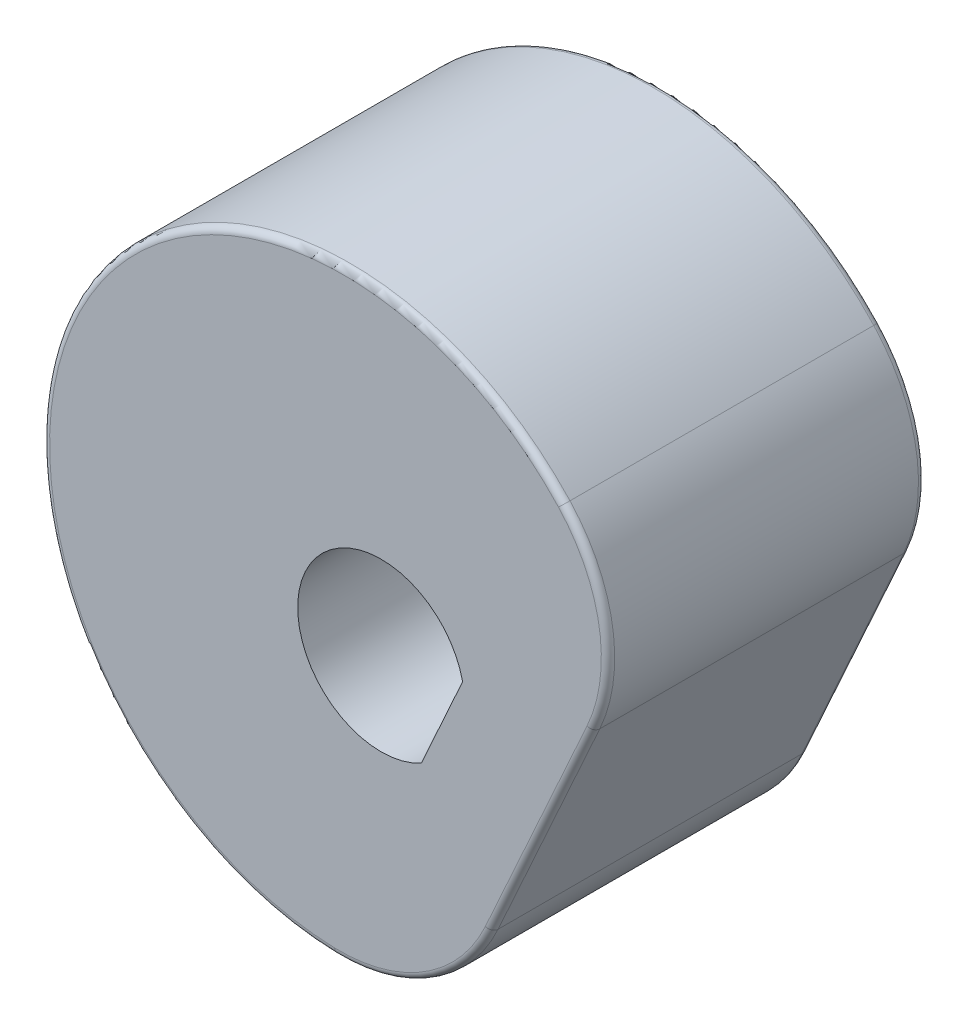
ISO-10303-21;
HEADER;
FILE_DESCRIPTION(('STEP AP214'),'2;1');
FILE_NAME('part.step','',(''),(''),'','','');
FILE_SCHEMA(('AUTOMOTIVE_DESIGN { 1 0 10303 214 1 1 1 1 }'));
ENDSEC;
DATA;
#1=APPLICATION_CONTEXT('core data for automotive mechanical design processes');
#2=APPLICATION_PROTOCOL_DEFINITION('international standard','automotive_design',2000,#1);
#3=PRODUCT_CONTEXT('',#1,'mechanical');
#4=PRODUCT('Part','Part','',(#3));
#5=PRODUCT_RELATED_PRODUCT_CATEGORY('part','',(#4));
#6=PRODUCT_DEFINITION_FORMATION('','',#4);
#7=PRODUCT_DEFINITION_CONTEXT('part definition',#1,'design');
#8=PRODUCT_DEFINITION('design','',#6,#7);
#9=PRODUCT_DEFINITION_SHAPE('','',#8);
#10=(LENGTH_UNIT() NAMED_UNIT(*) SI_UNIT(.MILLI.,.METRE.));
#11=(NAMED_UNIT(*) PLANE_ANGLE_UNIT() SI_UNIT($,.RADIAN.));
#12=(NAMED_UNIT(*) SI_UNIT($,.STERADIAN.) SOLID_ANGLE_UNIT());
#13=UNCERTAINTY_MEASURE_WITH_UNIT(LENGTH_MEASURE(1.E-05),#10,'distance_accuracy_value','');
#14=(GEOMETRIC_REPRESENTATION_CONTEXT(3) GLOBAL_UNCERTAINTY_ASSIGNED_CONTEXT((#13)) GLOBAL_UNIT_ASSIGNED_CONTEXT((#10,
#11,#12)) REPRESENTATION_CONTEXT('',''));
#15=CARTESIAN_POINT('',(0.,0.,0.));
#16=DIRECTION('',(0.,0.,1.));
#17=DIRECTION('',(1.,0.,0.));
#18=AXIS2_PLACEMENT_3D('',#15,#16,#17);
#19=CARTESIAN_POINT('',(-8.59914116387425,107.854598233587,48.1999999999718));
#20=DIRECTION('',(0.,0.,1.));
#21=DIRECTION('',(1.,0.,0.));
#22=AXIS2_PLACEMENT_3D('',#19,#20,#21);
#23=CYLINDRICAL_SURFACE('',#22,4.99999999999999);
#24=DIRECTION('',(0.,0.,1.));
#25=VECTOR('',#24,1.);
#26=CARTESIAN_POINT('',(-4.93802283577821,111.259919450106,48.1999999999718));
#27=LINE('',#26,#25);
#28=CARTESIAN_POINT('',(-4.93802283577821,111.259919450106,48.3999999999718));
#29=VERTEX_POINT('',#28);
#30=CARTESIAN_POINT('',(-4.93802283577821,111.259919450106,57.4999999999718));
#31=VERTEX_POINT('',#30);
#32=EDGE_CURVE('E140',#29,#31,#27,.T.);
#33=ORIENTED_EDGE('',*,*,#32,.T.);
#34=CARTESIAN_POINT('',(-8.59914116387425,107.854598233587,57.4999999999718));
#35=DIRECTION('',(0.,0.,1.));
#36=DIRECTION('',(1.,0.,0.));
#37=AXIS2_PLACEMENT_3D('',#34,#35,#36);
#38=CIRCLE('',#37,4.99999999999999);
#39=CARTESIAN_POINT('',(-4.0448911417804,105.790910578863,57.4999999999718));
#40=VERTEX_POINT('',#39);
#41=EDGE_CURVE('E180',#31,#40,#38,.F.);
#42=ORIENTED_EDGE('',*,*,#41,.T.);
#43=DIRECTION('',(0.,0.,1.));
#44=VECTOR('',#43,1.);
#45=CARTESIAN_POINT('',(-4.0448911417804,105.790910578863,48.1999999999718));
#46=LINE('',#45,#44);
#47=CARTESIAN_POINT('',(-4.0448911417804,105.790910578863,48.3999999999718));
#48=VERTEX_POINT('',#47);
#49=EDGE_CURVE('E142',#48,#40,#46,.T.);
#50=ORIENTED_EDGE('',*,*,#49,.F.);
#51=CARTESIAN_POINT('',(-8.59914116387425,107.854598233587,48.3999999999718));
#52=DIRECTION('',(0.,0.,1.));
#53=DIRECTION('',(1.,0.,0.));
#54=AXIS2_PLACEMENT_3D('',#51,#52,#53);
#55=CIRCLE('',#54,4.99999999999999);
#56=EDGE_CURVE('E60',#48,#29,#55,.T.);
#57=ORIENTED_EDGE('',*,*,#56,.T.);
#58=EDGE_LOOP('',(#33,#42,#50,#57));
#59=FACE_BOUND('',#58,.T.);
#60=ADVANCED_FACE('F37',(#59),#23,.T.);
#61=CARTESIAN_POINT('',(-7.09110397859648,99.0683744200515,48.1999999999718));
#62=DIRECTION('',(0.910850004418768,-0.412737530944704,0.));
#63=DIRECTION('',(0.412737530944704,0.910850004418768,0.));
#64=AXIS2_PLACEMENT_3D('',#61,#62,#63);
#65=PLANE('',#64);
#66=ORIENTED_EDGE('',*,*,#49,.T.);
#67=DIRECTION('',(0.412737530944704,0.910850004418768,0.));
#68=VECTOR('',#67,1.);
#69=CARTESIAN_POINT('',(-7.09110397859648,99.0683744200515,57.4999999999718));
#70=LINE('',#69,#68);
#71=CARTESIAN_POINT('',(-7.09110397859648,99.0683744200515,57.4999999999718));
#72=VERTEX_POINT('',#71);
#73=EDGE_CURVE('E177',#40,#72,#70,.F.);
#74=ORIENTED_EDGE('',*,*,#73,.T.);
#75=DIRECTION('',(0.,0.,1.));
#76=VECTOR('',#75,1.);
#77=CARTESIAN_POINT('',(-7.09110397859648,99.0683744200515,48.1999999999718));
#78=LINE('',#77,#76);
#79=CARTESIAN_POINT('',(-7.09110397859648,99.0683744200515,48.3999999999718));
#80=VERTEX_POINT('',#79);
#81=EDGE_CURVE('E146',#80,#72,#78,.T.);
#82=ORIENTED_EDGE('',*,*,#81,.F.);
#83=DIRECTION('',(0.412737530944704,0.910850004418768,0.));
#84=VECTOR('',#83,1.);
#85=CARTESIAN_POINT('',(-4.0448911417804,105.790910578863,48.3999999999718));
#86=LINE('',#85,#84);
#87=EDGE_CURVE('E175',#80,#48,#86,.T.);
#88=ORIENTED_EDGE('',*,*,#87,.T.);
#89=EDGE_LOOP('',(#66,#74,#82,#88));
#90=FACE_BOUND('',#89,.T.);
#91=ADVANCED_FACE('F211',(#90),#65,.T.);
#92=CARTESIAN_POINT('',(-11.6453540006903,101.132062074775,48.1999999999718));
#93=DIRECTION('',(0.,0.,1.));
#94=DIRECTION('',(1.,0.,0.));
#95=AXIS2_PLACEMENT_3D('',#92,#93,#94);
#96=CYLINDRICAL_SURFACE('',#95,4.99999999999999);
#97=DIRECTION('',(0.,0.,1.));
#98=VECTOR('',#97,1.);
#99=CARTESIAN_POINT('',(-11.7920017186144,96.1342130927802,48.1999999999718));
#100=LINE('',#99,#98);
#101=CARTESIAN_POINT('',(-11.7920017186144,96.1342130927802,48.3999999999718));
#102=VERTEX_POINT('',#101);
#103=CARTESIAN_POINT('',(-11.7920017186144,96.1342130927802,57.4999999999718));
#104=VERTEX_POINT('',#103);
#105=EDGE_CURVE('E149',#102,#104,#100,.T.);
#106=ORIENTED_EDGE('',*,*,#105,.F.);
#107=CARTESIAN_POINT('',(-11.6453540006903,101.132062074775,48.3999999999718));
#108=DIRECTION('',(0.,0.,1.));
#109=DIRECTION('',(1.,0.,0.));
#110=AXIS2_PLACEMENT_3D('',#107,#108,#109);
#111=CIRCLE('',#110,4.99999999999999);
#112=EDGE_CURVE('E154',#102,#80,#111,.T.);
#113=ORIENTED_EDGE('',*,*,#112,.T.);
#114=ORIENTED_EDGE('',*,*,#81,.T.);
#115=CARTESIAN_POINT('',(-11.6453540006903,101.132062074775,57.4999999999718));
#116=DIRECTION('',(0.,0.,1.));
#117=DIRECTION('',(1.,0.,0.));
#118=AXIS2_PLACEMENT_3D('',#115,#116,#117);
#119=CIRCLE('',#118,4.99999999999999);
#120=EDGE_CURVE('E145',#72,#104,#119,.F.);
#121=ORIENTED_EDGE('',*,*,#120,.T.);
#122=EDGE_LOOP('',(#106,#113,#114,#121));
#123=FACE_BOUND('',#122,.T.);
#124=ADVANCED_FACE('F222',(#123),#96,.T.);
#125=CARTESIAN_POINT('',(-11.528035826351,105.130341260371,48.1999999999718));
#126=DIRECTION('',(0.,0.,1.));
#127=DIRECTION('',(1.,0.,0.));
#128=AXIS2_PLACEMENT_3D('',#125,#126,#127);
#129=CYLINDRICAL_SURFACE('',#128,8.99999999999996);
#130=ORIENTED_EDGE('',*,*,#32,.F.);
#131=CARTESIAN_POINT('',(-11.528035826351,105.130341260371,48.3999999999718));
#132=DIRECTION('',(0.,0.,1.));
#133=DIRECTION('',(1.,0.,0.));
#134=AXIS2_PLACEMENT_3D('',#131,#132,#133);
#135=CIRCLE('',#134,8.99999999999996);
#136=EDGE_CURVE('E11',#29,#102,#135,.T.);
#137=ORIENTED_EDGE('',*,*,#136,.T.);
#138=ORIENTED_EDGE('',*,*,#105,.T.);
#139=CARTESIAN_POINT('',(-11.528035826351,105.130341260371,57.4999999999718));
#140=DIRECTION('',(0.,0.,1.));
#141=DIRECTION('',(1.,0.,0.));
#142=AXIS2_PLACEMENT_3D('',#139,#140,#141);
#143=CIRCLE('',#142,8.99999999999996);
#144=EDGE_CURVE('E46',#104,#31,#143,.F.);
#145=ORIENTED_EDGE('',*,*,#144,.T.);
#146=EDGE_LOOP('',(#130,#137,#138,#145));
#147=FACE_BOUND('',#146,.T.);
#148=ADVANCED_FACE('F237',(#147),#129,.T.);
#149=CARTESIAN_POINT('',(-8.59914116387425,107.854598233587,48.1999999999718));
#150=DIRECTION('',(0.,0.,1.));
#151=DIRECTION('',(1.,0.,0.));
#152=AXIS2_PLACEMENT_3D('',#149,#150,#151);
#153=PLANE('',#152);
#154=DIRECTION('',(0.412737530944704,0.910850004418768,0.));
#155=VECTOR('',#154,1.);
#156=CARTESIAN_POINT('',(-7.27327397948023,99.1509219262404,48.1999999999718));
#157=LINE('',#156,#155);
#158=CARTESIAN_POINT('',(-4.22706114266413,105.873458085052,48.1999999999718));
#159=VERTEX_POINT('',#158);
#160=CARTESIAN_POINT('',(-7.27327397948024,99.1509219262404,48.1999999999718));
#161=VERTEX_POINT('',#160);
#162=EDGE_CURVE('E161',#159,#161,#157,.F.);
#163=ORIENTED_EDGE('',*,*,#162,.T.);
#164=CARTESIAN_POINT('',(-11.6453540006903,101.132062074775,48.1999999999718));
#165=DIRECTION('',(0.,0.,1.));
#166=DIRECTION('',(1.,0.,0.));
#167=AXIS2_PLACEMENT_3D('',#164,#165,#166);
#168=CIRCLE('',#167,4.79999999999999);
#169=CARTESIAN_POINT('',(-11.7861358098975,96.33412705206,48.1999999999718));
#170=VERTEX_POINT('',#169);
#171=EDGE_CURVE('E163',#161,#170,#168,.F.);
#172=ORIENTED_EDGE('',*,*,#171,.T.);
#173=CARTESIAN_POINT('',(-11.528035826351,105.130341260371,48.1999999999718));
#174=DIRECTION('',(0.,0.,1.));
#175=DIRECTION('',(1.,0.,0.));
#176=AXIS2_PLACEMENT_3D('',#173,#174,#175);
#177=CIRCLE('',#176,8.79999999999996);
#178=CARTESIAN_POINT('',(-5.08446756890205,111.123706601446,48.1999999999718));
#179=VERTEX_POINT('',#178);
#180=EDGE_CURVE('E157',#170,#179,#177,.F.);
#181=ORIENTED_EDGE('',*,*,#180,.T.);
#182=CARTESIAN_POINT('',(-8.59914116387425,107.854598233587,48.1999999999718));
#183=DIRECTION('',(0.,0.,1.));
#184=DIRECTION('',(1.,0.,0.));
#185=AXIS2_PLACEMENT_3D('',#182,#183,#184);
#186=CIRCLE('',#185,4.79999999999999);
#187=EDGE_CURVE('E159',#179,#159,#186,.F.);
#188=ORIENTED_EDGE('',*,*,#187,.T.);
#189=EDGE_LOOP('',(#163,#172,#181,#188));
#190=FACE_BOUND('',#189,.T.);
#191=DIRECTION('',(0.412737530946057,0.910850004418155,0.));
#192=VECTOR('',#191,1.);
#193=CARTESIAN_POINT('',(-7.95469627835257,105.157951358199,48.1999999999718));
#194=LINE('',#193,#192);
#195=CARTESIAN_POINT('',(-9.19290887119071,102.425401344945,48.1999999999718));
#196=VERTEX_POINT('',#195);
#197=CARTESIAN_POINT('',(-7.95469627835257,105.157951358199,48.1999999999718));
#198=VERTEX_POINT('',#197);
#199=EDGE_CURVE('E127',#196,#198,#194,.T.);
#200=ORIENTED_EDGE('',*,*,#199,.T.);
#201=CARTESIAN_POINT('',(-10.395502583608,104.617151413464,48.1999999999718));
#202=DIRECTION('',(0.,0.,1.));
#203=DIRECTION('',(-1.,0.,0.));
#204=AXIS2_PLACEMENT_3D('',#201,#202,#203);
#205=CIRCLE('',#204,2.49999999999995);
#206=EDGE_CURVE('E119',#198,#196,#205,.T.);
#207=ORIENTED_EDGE('',*,*,#206,.T.);
#208=EDGE_LOOP('',(#200,#207));
#209=FACE_BOUND('',#208,.T.);
#210=ADVANCED_FACE('F133',(#190,#209),#153,.F.);
#211=CARTESIAN_POINT('',(-8.59914116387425,107.854598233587,57.6999999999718));
#212=DIRECTION('',(0.,0.,1.));
#213=DIRECTION('',(1.,0.,0.));
#214=AXIS2_PLACEMENT_3D('',#211,#212,#213);
#215=PLANE('',#214);
#216=CARTESIAN_POINT('',(-11.528035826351,105.130341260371,57.6999999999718));
#217=DIRECTION('',(0.,0.,1.));
#218=DIRECTION('',(1.,0.,0.));
#219=AXIS2_PLACEMENT_3D('',#216,#217,#218);
#220=CIRCLE('',#219,8.79999999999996);
#221=CARTESIAN_POINT('',(-5.08446756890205,111.123706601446,57.6999999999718));
#222=VERTEX_POINT('',#221);
#223=CARTESIAN_POINT('',(-11.7861358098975,96.33412705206,57.6999999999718));
#224=VERTEX_POINT('',#223);
#225=EDGE_CURVE('E166',#222,#224,#220,.T.);
#226=ORIENTED_EDGE('',*,*,#225,.T.);
#227=CARTESIAN_POINT('',(-11.6453540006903,101.132062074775,57.6999999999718));
#228=DIRECTION('',(0.,0.,1.));
#229=DIRECTION('',(1.,0.,0.));
#230=AXIS2_PLACEMENT_3D('',#227,#228,#229);
#231=CIRCLE('',#230,4.79999999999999);
#232=CARTESIAN_POINT('',(-7.27327397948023,99.1509219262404,57.6999999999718));
#233=VERTEX_POINT('',#232);
#234=EDGE_CURVE('E172',#224,#233,#231,.T.);
#235=ORIENTED_EDGE('',*,*,#234,.T.);
#236=DIRECTION('',(0.412737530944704,0.910850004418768,0.));
#237=VECTOR('',#236,1.);
#238=CARTESIAN_POINT('',(-4.2270611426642,105.873458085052,57.6999999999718));
#239=LINE('',#238,#237);
#240=CARTESIAN_POINT('',(-4.22706114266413,105.873458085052,57.6999999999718));
#241=VERTEX_POINT('',#240);
#242=EDGE_CURVE('E170',#233,#241,#239,.T.);
#243=ORIENTED_EDGE('',*,*,#242,.T.);
#244=CARTESIAN_POINT('',(-8.59914116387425,107.854598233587,57.6999999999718));
#245=DIRECTION('',(0.,0.,1.));
#246=DIRECTION('',(1.,0.,0.));
#247=AXIS2_PLACEMENT_3D('',#244,#245,#246);
#248=CIRCLE('',#247,4.79999999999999);
#249=EDGE_CURVE('E168',#241,#222,#248,.T.);
#250=ORIENTED_EDGE('',*,*,#249,.T.);
#251=EDGE_LOOP('',(#226,#235,#243,#250));
#252=FACE_BOUND('',#251,.T.);
#253=CARTESIAN_POINT('',(-10.395502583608,104.617151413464,57.6999999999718));
#254=DIRECTION('',(0.,0.,1.));
#255=DIRECTION('',(-1.,0.,0.));
#256=AXIS2_PLACEMENT_3D('',#253,#254,#255);
#257=CIRCLE('',#256,2.49999999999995);
#258=CARTESIAN_POINT('',(-7.95469627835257,105.157951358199,57.6999999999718));
#259=VERTEX_POINT('',#258);
#260=CARTESIAN_POINT('',(-9.19290887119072,102.425401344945,57.6999999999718));
#261=VERTEX_POINT('',#260);
#262=EDGE_CURVE('E122',#259,#261,#257,.T.);
#263=ORIENTED_EDGE('',*,*,#262,.F.);
#264=DIRECTION('',(0.412737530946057,0.910850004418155,0.));
#265=VECTOR('',#264,1.);
#266=CARTESIAN_POINT('',(-7.95469627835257,105.157951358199,57.6999999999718));
#267=LINE('',#266,#265);
#268=EDGE_CURVE('E134',#261,#259,#267,.T.);
#269=ORIENTED_EDGE('',*,*,#268,.F.);
#270=EDGE_LOOP('',(#263,#269));
#271=FACE_BOUND('',#270,.T.);
#272=ADVANCED_FACE('F244',(#252,#271),#215,.T.);
#273=CARTESIAN_POINT('',(-10.395502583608,104.617151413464,48.1999999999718));
#274=DIRECTION('',(0.,0.,1.));
#275=DIRECTION('',(1.,0.,0.));
#276=AXIS2_PLACEMENT_3D('',#273,#274,#275);
#277=CYLINDRICAL_SURFACE('',#276,2.49999999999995);
#278=ORIENTED_EDGE('',*,*,#262,.T.);
#279=DIRECTION('',(0.,0.,1.));
#280=VECTOR('',#279,1.);
#281=CARTESIAN_POINT('',(-9.19290887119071,102.425401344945,48.1999999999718));
#282=LINE('',#281,#280);
#283=EDGE_CURVE('E115',#196,#261,#282,.T.);
#284=ORIENTED_EDGE('',*,*,#283,.F.);
#285=ORIENTED_EDGE('',*,*,#206,.F.);
#286=DIRECTION('',(0.,0.,1.));
#287=VECTOR('',#286,1.);
#288=CARTESIAN_POINT('',(-7.95469627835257,105.157951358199,48.1999999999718));
#289=LINE('',#288,#287);
#290=EDGE_CURVE('E126',#198,#259,#289,.T.);
#291=ORIENTED_EDGE('',*,*,#290,.T.);
#292=EDGE_LOOP('',(#278,#284,#285,#291));
#293=FACE_BOUND('',#292,.T.);
#294=ADVANCED_FACE('F117',(#293),#277,.F.);
#295=CARTESIAN_POINT('',(-7.95469627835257,105.157951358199,48.1999999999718));
#296=DIRECTION('',(0.910850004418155,-0.412737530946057,0.));
#297=DIRECTION('',(0.412737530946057,0.910850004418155,0.));
#298=AXIS2_PLACEMENT_3D('',#295,#296,#297);
#299=PLANE('',#298);
#300=ORIENTED_EDGE('',*,*,#268,.T.);
#301=ORIENTED_EDGE('',*,*,#290,.F.);
#302=ORIENTED_EDGE('',*,*,#199,.F.);
#303=ORIENTED_EDGE('',*,*,#283,.T.);
#304=EDGE_LOOP('',(#300,#301,#302,#303));
#305=FACE_BOUND('',#304,.T.);
#306=ADVANCED_FACE('F130',(#305),#299,.F.);
#307=CARTESIAN_POINT('',(-8.59914116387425,107.854598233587,48.3999999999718));
#308=DIRECTION('',(0.,0.,1.));
#309=DIRECTION('',(1.,0.,0.));
#310=AXIS2_PLACEMENT_3D('',#307,#308,#309);
#311=TOROIDAL_SURFACE('',#310,4.79999999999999,0.2);
#312=CARTESIAN_POINT('',(-4.22706114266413,105.873458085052,48.3999999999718));
#313=DIRECTION('',(-0.412737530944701,-0.910850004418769,0.));
#314=DIRECTION('',(0.910850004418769,-0.412737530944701,0.));
#315=AXIS2_PLACEMENT_3D('',#312,#313,#314);
#316=CIRCLE('',#315,0.2);
#317=EDGE_CURVE('E187',#159,#48,#316,.T.);
#318=ORIENTED_EDGE('',*,*,#317,.F.);
#319=ORIENTED_EDGE('',*,*,#187,.F.);
#320=CARTESIAN_POINT('',(-5.08446756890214,111.123706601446,48.3999999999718));
#321=DIRECTION('',(-0.681064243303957,0.732223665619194,0.));
#322=DIRECTION('',(-0.732223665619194,-0.681064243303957,0.));
#323=AXIS2_PLACEMENT_3D('',#320,#321,#322);
#324=CIRCLE('',#323,0.2);
#325=EDGE_CURVE('E138',#29,#179,#324,.T.);
#326=ORIENTED_EDGE('',*,*,#325,.F.);
#327=ORIENTED_EDGE('',*,*,#56,.F.);
#328=EDGE_LOOP('',(#318,#319,#326,#327));
#329=FACE_BOUND('',#328,.T.);
#330=ADVANCED_FACE('F233',(#329),#311,.T.);
#331=CARTESIAN_POINT('',(-11.528035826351,105.130341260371,48.3999999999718));
#332=DIRECTION('',(0.,0.,1.));
#333=DIRECTION('',(1.,0.,0.));
#334=AXIS2_PLACEMENT_3D('',#331,#332,#333);
#335=TOROIDAL_SURFACE('',#334,8.79999999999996,0.2);
#336=ORIENTED_EDGE('',*,*,#325,.T.);
#337=ORIENTED_EDGE('',*,*,#180,.F.);
#338=CARTESIAN_POINT('',(-11.7861358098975,96.33412705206,48.3999999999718));
#339=DIRECTION('',(0.999569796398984,-0.0293295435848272,0.));
#340=DIRECTION('',(0.0293295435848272,0.999569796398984,0.));
#341=AXIS2_PLACEMENT_3D('',#338,#339,#340);
#342=CIRCLE('',#341,0.2);
#343=EDGE_CURVE('E185',#102,#170,#342,.T.);
#344=ORIENTED_EDGE('',*,*,#343,.F.);
#345=ORIENTED_EDGE('',*,*,#136,.F.);
#346=EDGE_LOOP('',(#336,#337,#344,#345));
#347=FACE_BOUND('',#346,.T.);
#348=ADVANCED_FACE('F236',(#347),#335,.T.);
#349=CARTESIAN_POINT('',(-7.27327397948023,99.1509219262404,48.3999999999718));
#350=DIRECTION('',(-0.412737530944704,-0.910850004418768,0.));
#351=DIRECTION('',(0.910850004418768,-0.412737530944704,0.));
#352=AXIS2_PLACEMENT_3D('',#349,#350,#351);
#353=CYLINDRICAL_SURFACE('',#352,0.2);
#354=ORIENTED_EDGE('',*,*,#317,.T.);
#355=ORIENTED_EDGE('',*,*,#87,.F.);
#356=CARTESIAN_POINT('',(-7.27327397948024,99.1509219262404,48.3999999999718));
#357=DIRECTION('',(-0.412737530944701,-0.910850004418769,0.));
#358=DIRECTION('',(0.910850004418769,-0.412737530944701,0.));
#359=AXIS2_PLACEMENT_3D('',#356,#357,#358);
#360=CIRCLE('',#359,0.2);
#361=EDGE_CURVE('E183',#161,#80,#360,.T.);
#362=ORIENTED_EDGE('',*,*,#361,.F.);
#363=ORIENTED_EDGE('',*,*,#162,.F.);
#364=EDGE_LOOP('',(#354,#355,#362,#363));
#365=FACE_BOUND('',#364,.T.);
#366=ADVANCED_FACE('F216',(#365),#353,.T.);
#367=CARTESIAN_POINT('',(-11.6453540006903,101.132062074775,48.3999999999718));
#368=DIRECTION('',(0.,0.,1.));
#369=DIRECTION('',(1.,0.,0.));
#370=AXIS2_PLACEMENT_3D('',#367,#368,#369);
#371=TOROIDAL_SURFACE('',#370,4.79999999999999,0.2);
#372=ORIENTED_EDGE('',*,*,#343,.T.);
#373=ORIENTED_EDGE('',*,*,#171,.F.);
#374=ORIENTED_EDGE('',*,*,#361,.T.);
#375=ORIENTED_EDGE('',*,*,#112,.F.);
#376=EDGE_LOOP('',(#372,#373,#374,#375));
#377=FACE_BOUND('',#376,.T.);
#378=ADVANCED_FACE('F226',(#377),#371,.T.);
#379=CARTESIAN_POINT('',(-8.59914116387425,107.854598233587,57.4999999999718));
#380=DIRECTION('',(0.,0.,1.));
#381=DIRECTION('',(1.,0.,0.));
#382=AXIS2_PLACEMENT_3D('',#379,#380,#381);
#383=TOROIDAL_SURFACE('',#382,4.79999999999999,0.2);
#384=CARTESIAN_POINT('',(-4.22706114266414,105.873458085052,57.4999999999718));
#385=DIRECTION('',(-0.412737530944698,-0.910850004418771,0.));
#386=DIRECTION('',(0.910850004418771,-0.412737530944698,0.));
#387=AXIS2_PLACEMENT_3D('',#384,#385,#386);
#388=CIRCLE('',#387,0.2);
#389=EDGE_CURVE('E195',#40,#241,#388,.T.);
#390=ORIENTED_EDGE('',*,*,#389,.F.);
#391=ORIENTED_EDGE('',*,*,#41,.F.);
#392=CARTESIAN_POINT('',(-5.08446756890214,111.123706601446,57.4999999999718));
#393=DIRECTION('',(-0.681064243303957,0.732223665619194,0.));
#394=DIRECTION('',(-0.732223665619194,-0.681064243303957,0.));
#395=AXIS2_PLACEMENT_3D('',#392,#393,#394);
#396=CIRCLE('',#395,0.2);
#397=EDGE_CURVE('E41',#222,#31,#396,.T.);
#398=ORIENTED_EDGE('',*,*,#397,.F.);
#399=ORIENTED_EDGE('',*,*,#249,.F.);
#400=EDGE_LOOP('',(#390,#391,#398,#399));
#401=FACE_BOUND('',#400,.T.);
#402=ADVANCED_FACE('F39',(#401),#383,.T.);
#403=CARTESIAN_POINT('',(-11.528035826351,105.130341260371,57.4999999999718));
#404=DIRECTION('',(0.,0.,1.));
#405=DIRECTION('',(1.,0.,0.));
#406=AXIS2_PLACEMENT_3D('',#403,#404,#405);
#407=TOROIDAL_SURFACE('',#406,8.79999999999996,0.2);
#408=ORIENTED_EDGE('',*,*,#397,.T.);
#409=ORIENTED_EDGE('',*,*,#144,.F.);
#410=CARTESIAN_POINT('',(-11.7861358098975,96.33412705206,57.4999999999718));
#411=DIRECTION('',(0.999569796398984,-0.0293295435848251,0.));
#412=DIRECTION('',(0.0293295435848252,0.999569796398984,0.));
#413=AXIS2_PLACEMENT_3D('',#410,#411,#412);
#414=CIRCLE('',#413,0.2);
#415=EDGE_CURVE('E194',#224,#104,#414,.T.);
#416=ORIENTED_EDGE('',*,*,#415,.F.);
#417=ORIENTED_EDGE('',*,*,#225,.F.);
#418=EDGE_LOOP('',(#408,#409,#416,#417));
#419=FACE_BOUND('',#418,.T.);
#420=ADVANCED_FACE('F205',(#419),#407,.T.);
#421=CARTESIAN_POINT('',(-4.2270611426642,105.873458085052,57.4999999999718));
#422=DIRECTION('',(0.412737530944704,0.910850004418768,0.));
#423=DIRECTION('',(-0.910850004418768,0.412737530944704,0.));
#424=AXIS2_PLACEMENT_3D('',#421,#422,#423);
#425=CYLINDRICAL_SURFACE('',#424,0.2);
#426=ORIENTED_EDGE('',*,*,#389,.T.);
#427=ORIENTED_EDGE('',*,*,#242,.F.);
#428=CARTESIAN_POINT('',(-7.27327397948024,99.1509219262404,57.4999999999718));
#429=DIRECTION('',(-0.412737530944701,-0.910850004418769,0.));
#430=DIRECTION('',(0.910850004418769,-0.412737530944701,0.));
#431=AXIS2_PLACEMENT_3D('',#428,#429,#430);
#432=CIRCLE('',#431,0.2);
#433=EDGE_CURVE('E192',#72,#233,#432,.T.);
#434=ORIENTED_EDGE('',*,*,#433,.F.);
#435=ORIENTED_EDGE('',*,*,#73,.F.);
#436=EDGE_LOOP('',(#426,#427,#434,#435));
#437=FACE_BOUND('',#436,.T.);
#438=ADVANCED_FACE('F265',(#437),#425,.T.);
#439=CARTESIAN_POINT('',(-11.6453540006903,101.132062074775,57.4999999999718));
#440=DIRECTION('',(0.,0.,1.));
#441=DIRECTION('',(1.,0.,0.));
#442=AXIS2_PLACEMENT_3D('',#439,#440,#441);
#443=TOROIDAL_SURFACE('',#442,4.79999999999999,0.2);
#444=ORIENTED_EDGE('',*,*,#415,.T.);
#445=ORIENTED_EDGE('',*,*,#120,.F.);
#446=ORIENTED_EDGE('',*,*,#433,.T.);
#447=ORIENTED_EDGE('',*,*,#234,.F.);
#448=EDGE_LOOP('',(#444,#445,#446,#447));
#449=FACE_BOUND('',#448,.T.);
#450=ADVANCED_FACE('F262',(#449),#443,.T.);
#451=CLOSED_SHELL('',(#60,#91,#124,#148,#210,#272,#294,#306,#330,#348,#366,#378,#402,#420,#438,#450));
#452=MANIFOLD_SOLID_BREP('B2',#451);
#453=ADVANCED_BREP_SHAPE_REPRESENTATION('',(#18,#452),#14);
#454=SHAPE_DEFINITION_REPRESENTATION(#9,#453);
ENDSEC;
END-ISO-10303-21;
